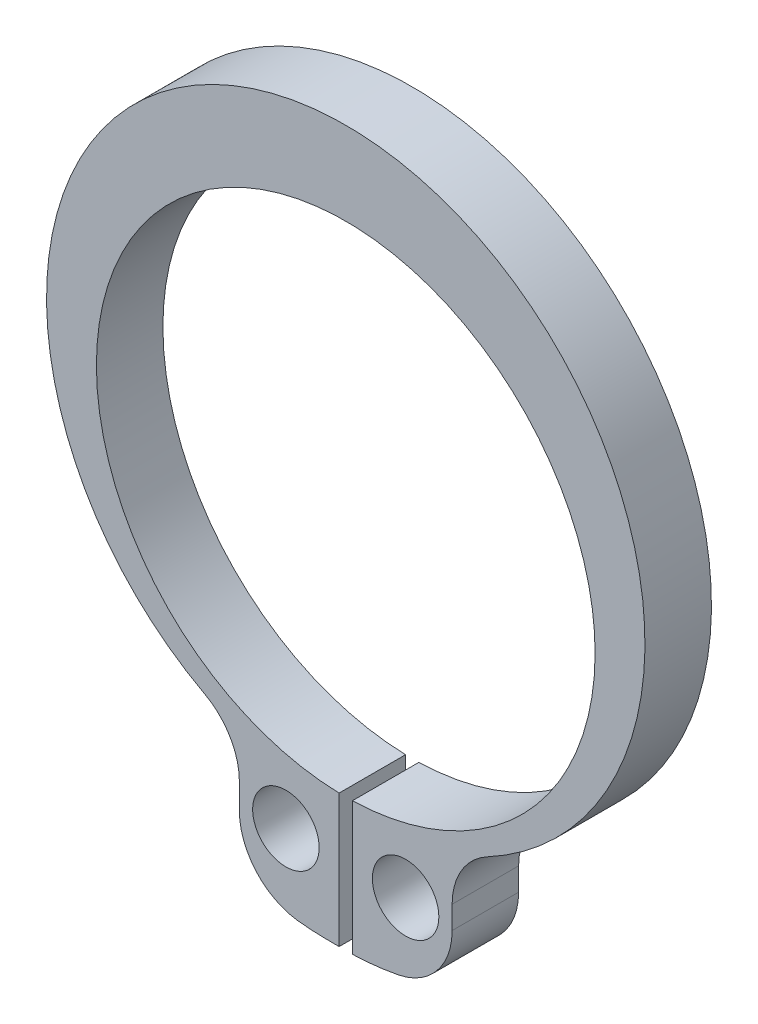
ISO-10303-21;
HEADER;
FILE_DESCRIPTION(('STEP AP214'),'2;1');
FILE_NAME('part.step','',(''),(''),'','','');
FILE_SCHEMA(('AUTOMOTIVE_DESIGN { 1 0 10303 214 1 1 1 1 }'));
ENDSEC;
DATA;
#1=APPLICATION_CONTEXT('core data for automotive mechanical design processes');
#2=APPLICATION_PROTOCOL_DEFINITION('international standard','automotive_design',2000,#1);
#3=PRODUCT_CONTEXT('',#1,'mechanical');
#4=PRODUCT('Part','Part','',(#3));
#5=PRODUCT_RELATED_PRODUCT_CATEGORY('part','',(#4));
#6=PRODUCT_DEFINITION_FORMATION('','',#4);
#7=PRODUCT_DEFINITION_CONTEXT('part definition',#1,'design');
#8=PRODUCT_DEFINITION('design','',#6,#7);
#9=PRODUCT_DEFINITION_SHAPE('','',#8);
#10=(LENGTH_UNIT() NAMED_UNIT(*) SI_UNIT(.MILLI.,.METRE.));
#11=(NAMED_UNIT(*) PLANE_ANGLE_UNIT() SI_UNIT($,.RADIAN.));
#12=(NAMED_UNIT(*) SI_UNIT($,.STERADIAN.) SOLID_ANGLE_UNIT());
#13=UNCERTAINTY_MEASURE_WITH_UNIT(LENGTH_MEASURE(1.E-05),#10,'distance_accuracy_value','');
#14=(GEOMETRIC_REPRESENTATION_CONTEXT(3) GLOBAL_UNCERTAINTY_ASSIGNED_CONTEXT((#13)) GLOBAL_UNIT_ASSIGNED_CONTEXT((#10,
#11,#12)) REPRESENTATION_CONTEXT('',''));
#15=CARTESIAN_POINT('',(0.,0.,0.));
#16=DIRECTION('',(0.,0.,1.));
#17=DIRECTION('',(1.,0.,0.));
#18=AXIS2_PLACEMENT_3D('',#15,#16,#17);
#19=CARTESIAN_POINT('',(0.,0.,1.));
#20=DIRECTION('',(0.,0.,-1.));
#21=DIRECTION('',(-1.,0.,0.));
#22=AXIS2_PLACEMENT_3D('',#19,#20,#21);
#23=CYLINDRICAL_SURFACE('',#22,3.75);
#24=CARTESIAN_POINT('',(0.,0.,0.));
#25=DIRECTION('',(0.,0.,-1.));
#26=DIRECTION('',(1.,0.,0.));
#27=AXIS2_PLACEMENT_3D('',#24,#25,#26);
#28=CIRCLE('',#27,3.75);
#29=CARTESIAN_POINT('',(-0.0999999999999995,-3.74866642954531,0.));
#30=VERTEX_POINT('',#29);
#31=CARTESIAN_POINT('',(0.1,-3.74866642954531,0.));
#32=VERTEX_POINT('',#31);
#33=EDGE_CURVE('E144',#30,#32,#28,.T.);
#34=ORIENTED_EDGE('',*,*,#33,.T.);
#35=DIRECTION('',(0.,0.,-1.));
#36=VECTOR('',#35,1.);
#37=CARTESIAN_POINT('',(0.1,-3.74866642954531,1.));
#38=LINE('',#37,#36);
#39=CARTESIAN_POINT('',(0.1,-3.74866642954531,1.));
#40=VERTEX_POINT('',#39);
#41=EDGE_CURVE('E125',#40,#32,#38,.T.);
#42=ORIENTED_EDGE('',*,*,#41,.F.);
#43=CARTESIAN_POINT('',(0.,0.,1.));
#44=DIRECTION('',(0.,0.,-1.));
#45=DIRECTION('',(1.,0.,0.));
#46=AXIS2_PLACEMENT_3D('',#43,#44,#45);
#47=CIRCLE('',#46,3.75);
#48=CARTESIAN_POINT('',(-0.0999999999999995,-3.74866642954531,1.));
#49=VERTEX_POINT('',#48);
#50=EDGE_CURVE('E132',#49,#40,#47,.T.);
#51=ORIENTED_EDGE('',*,*,#50,.F.);
#52=DIRECTION('',(0.,0.,-1.));
#53=VECTOR('',#52,1.);
#54=CARTESIAN_POINT('',(-0.0999999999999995,-3.74866642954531,1.));
#55=LINE('',#54,#53);
#56=EDGE_CURVE('E273',#49,#30,#55,.T.);
#57=ORIENTED_EDGE('',*,*,#56,.T.);
#58=EDGE_LOOP('',(#34,#42,#51,#57));
#59=FACE_BOUND('',#58,.T.);
#60=ADVANCED_FACE('F31',(#59),#23,.F.);
#61=CARTESIAN_POINT('',(0.1,-3.74866642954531,1.));
#62=DIRECTION('',(1.,0.,0.));
#63=DIRECTION('',(0.,1.,0.));
#64=AXIS2_PLACEMENT_3D('',#61,#62,#63);
#65=PLANE('',#64);
#66=DIRECTION('',(0.,-1.,0.));
#67=VECTOR('',#66,1.);
#68=CARTESIAN_POINT('',(0.1,-3.74866642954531,0.));
#69=LINE('',#68,#67);
#70=CARTESIAN_POINT('',(0.0999999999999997,-5.74866642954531,0.));
#71=VERTEX_POINT('',#70);
#72=EDGE_CURVE('E279',#32,#71,#69,.T.);
#73=ORIENTED_EDGE('',*,*,#72,.T.);
#74=DIRECTION('',(0.,0.,-1.));
#75=VECTOR('',#74,1.);
#76=CARTESIAN_POINT('',(0.0999999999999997,-5.74866642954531,1.));
#77=LINE('',#76,#75);
#78=CARTESIAN_POINT('',(0.0999999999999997,-5.74866642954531,1.));
#79=VERTEX_POINT('',#78);
#80=EDGE_CURVE('E128',#79,#71,#77,.T.);
#81=ORIENTED_EDGE('',*,*,#80,.F.);
#82=DIRECTION('',(0.,-1.,0.));
#83=VECTOR('',#82,1.);
#84=CARTESIAN_POINT('',(0.1,-3.74866642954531,1.));
#85=LINE('',#84,#83);
#86=EDGE_CURVE('E121',#40,#79,#85,.T.);
#87=ORIENTED_EDGE('',*,*,#86,.F.);
#88=ORIENTED_EDGE('',*,*,#41,.T.);
#89=EDGE_LOOP('',(#73,#81,#87,#88));
#90=FACE_BOUND('',#89,.T.);
#91=ADVANCED_FACE('F123',(#90),#65,.F.);
#92=CARTESIAN_POINT('',(-0.0174842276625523,-1.58267923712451,1.));
#93=DIRECTION('',(0.,0.,-1.));
#94=DIRECTION('',(-1.,0.,0.));
#95=AXIS2_PLACEMENT_3D('',#92,#93,#94);
#96=CYLINDRICAL_SURFACE('',#95,4.16764343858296);
#97=CARTESIAN_POINT('',(-0.0174842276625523,-1.58267923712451,0.));
#98=DIRECTION('',(0.,0.,1.));
#99=DIRECTION('',(1.,0.,0.));
#100=AXIS2_PLACEMENT_3D('',#97,#98,#99);
#101=CIRCLE('',#100,4.16764343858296);
#102=CARTESIAN_POINT('',(0.79493489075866,-5.67037137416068,0.));
#103=VERTEX_POINT('',#102);
#104=EDGE_CURVE('E195',#71,#103,#101,.T.);
#105=ORIENTED_EDGE('',*,*,#104,.T.);
#106=DIRECTION('',(0.,0.,-1.));
#107=VECTOR('',#106,1.);
#108=CARTESIAN_POINT('',(0.79493489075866,-5.67037137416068,1.));
#109=LINE('',#108,#107);
#110=CARTESIAN_POINT('',(0.79493489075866,-5.67037137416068,1.));
#111=VERTEX_POINT('',#110);
#112=EDGE_CURVE('E159',#103,#111,#109,.F.);
#113=ORIENTED_EDGE('',*,*,#112,.T.);
#114=CARTESIAN_POINT('',(-0.0174842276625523,-1.58267923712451,1.));
#115=DIRECTION('',(0.,0.,1.));
#116=DIRECTION('',(1.,0.,0.));
#117=AXIS2_PLACEMENT_3D('',#114,#115,#116);
#118=CIRCLE('',#117,4.16764343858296);
#119=EDGE_CURVE('E131',#79,#111,#118,.T.);
#120=ORIENTED_EDGE('',*,*,#119,.F.);
#121=ORIENTED_EDGE('',*,*,#80,.T.);
#122=EDGE_LOOP('',(#105,#113,#120,#121));
#123=FACE_BOUND('',#122,.T.);
#124=ADVANCED_FACE('F236',(#123),#96,.T.);
#125=CARTESIAN_POINT('',(1.6,-5.42364221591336,1.));
#126=DIRECTION('',(-1.,0.,0.));
#127=DIRECTION('',(0.,0.,1.));
#128=AXIS2_PLACEMENT_3D('',#125,#126,#127);
#129=PLANE('',#128);
#130=DIRECTION('',(0.,1.,0.));
#131=VECTOR('',#130,1.);
#132=CARTESIAN_POINT('',(1.6,-5.42364221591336,1.));
#133=LINE('',#132,#131);
#134=CARTESIAN_POINT('',(1.6,-4.68955518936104,1.));
#135=VERTEX_POINT('',#134);
#136=CARTESIAN_POINT('',(1.6,-4.34664832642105,1.));
#137=VERTEX_POINT('',#136);
#138=EDGE_CURVE('E202',#135,#137,#133,.T.);
#139=ORIENTED_EDGE('',*,*,#138,.F.);
#140=DIRECTION('',(0.,0.,-1.));
#141=VECTOR('',#140,1.);
#142=CARTESIAN_POINT('',(1.6,-4.68955518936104,1.));
#143=LINE('',#142,#141);
#144=CARTESIAN_POINT('',(1.6,-4.68955518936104,0.));
#145=VERTEX_POINT('',#144);
#146=EDGE_CURVE('E147',#135,#145,#143,.T.);
#147=ORIENTED_EDGE('',*,*,#146,.T.);
#148=DIRECTION('',(0.,1.,0.));
#149=VECTOR('',#148,1.);
#150=CARTESIAN_POINT('',(1.6,-5.42364221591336,0.));
#151=LINE('',#150,#149);
#152=CARTESIAN_POINT('',(1.6,-4.34664832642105,0.));
#153=VERTEX_POINT('',#152);
#154=EDGE_CURVE('E184',#145,#153,#151,.T.);
#155=ORIENTED_EDGE('',*,*,#154,.T.);
#156=DIRECTION('',(0.,0.,1.));
#157=VECTOR('',#156,1.);
#158=CARTESIAN_POINT('',(1.6,-4.34664832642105,1.));
#159=LINE('',#158,#157);
#160=EDGE_CURVE('E145',#153,#137,#159,.T.);
#161=ORIENTED_EDGE('',*,*,#160,.T.);
#162=EDGE_LOOP('',(#139,#147,#155,#161));
#163=FACE_BOUND('',#162,.T.);
#164=ADVANCED_FACE('F192',(#163),#129,.F.);
#165=CARTESIAN_POINT('',(0.,0.5,1.));
#166=DIRECTION('',(0.,0.,-1.));
#167=DIRECTION('',(-1.,0.,0.));
#168=AXIS2_PLACEMENT_3D('',#165,#166,#167);
#169=CYLINDRICAL_SURFACE('',#168,4.5);
#170=CARTESIAN_POINT('',(0.,0.5,0.));
#171=DIRECTION('',(0.,0.,1.));
#172=DIRECTION('',(1.,0.,0.));
#173=AXIS2_PLACEMENT_3D('',#170,#171,#172);
#174=CIRCLE('',#173,4.5);
#175=CARTESIAN_POINT('',(2.12727272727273,-3.46543953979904,0.));
#176=VERTEX_POINT('',#175);
#177=CARTESIAN_POINT('',(-2.12727272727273,-3.46543953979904,0.));
#178=VERTEX_POINT('',#177);
#179=EDGE_CURVE('E186',#176,#178,#174,.T.);
#180=ORIENTED_EDGE('',*,*,#179,.T.);
#181=DIRECTION('',(0.,0.,-1.));
#182=VECTOR('',#181,1.);
#183=CARTESIAN_POINT('',(-2.12727272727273,-3.46543953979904,1.));
#184=LINE('',#183,#182);
#185=CARTESIAN_POINT('',(-2.12727272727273,-3.46543953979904,1.));
#186=VERTEX_POINT('',#185);
#187=EDGE_CURVE('E174',#178,#186,#184,.F.);
#188=ORIENTED_EDGE('',*,*,#187,.T.);
#189=CARTESIAN_POINT('',(0.,0.5,1.));
#190=DIRECTION('',(0.,0.,1.));
#191=DIRECTION('',(1.,0.,0.));
#192=AXIS2_PLACEMENT_3D('',#189,#190,#191);
#193=CIRCLE('',#192,4.5);
#194=CARTESIAN_POINT('',(2.12727272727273,-3.46543953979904,1.));
#195=VERTEX_POINT('',#194);
#196=EDGE_CURVE('E200',#195,#186,#193,.T.);
#197=ORIENTED_EDGE('',*,*,#196,.F.);
#198=DIRECTION('',(0.,0.,-1.));
#199=VECTOR('',#198,1.);
#200=CARTESIAN_POINT('',(2.12727272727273,-3.46543953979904,1.));
#201=LINE('',#200,#199);
#202=EDGE_CURVE('E171',#195,#176,#201,.T.);
#203=ORIENTED_EDGE('',*,*,#202,.T.);
#204=EDGE_LOOP('',(#180,#188,#197,#203));
#205=FACE_BOUND('',#204,.T.);
#206=ADVANCED_FACE('F204',(#205),#169,.T.);
#207=CARTESIAN_POINT('',(-1.6,-5.438181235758,1.));
#208=DIRECTION('',(1.,0.,0.));
#209=DIRECTION('',(0.,1.,0.));
#210=AXIS2_PLACEMENT_3D('',#207,#208,#209);
#211=PLANE('',#210);
#212=DIRECTION('',(0.,-1.,0.));
#213=VECTOR('',#212,1.);
#214=CARTESIAN_POINT('',(-1.6,-5.438181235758,0.));
#215=LINE('',#214,#213);
#216=CARTESIAN_POINT('',(-1.6,-4.34664832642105,0.));
#217=VERTEX_POINT('',#216);
#218=CARTESIAN_POINT('',(-1.6,-4.72881648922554,0.));
#219=VERTEX_POINT('',#218);
#220=EDGE_CURVE('E260',#217,#219,#215,.T.);
#221=ORIENTED_EDGE('',*,*,#220,.T.);
#222=DIRECTION('',(0.,0.,-1.));
#223=VECTOR('',#222,1.);
#224=CARTESIAN_POINT('',(-1.6,-4.72881648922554,1.));
#225=LINE('',#224,#223);
#226=CARTESIAN_POINT('',(-1.6,-4.72881648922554,1.));
#227=VERTEX_POINT('',#226);
#228=EDGE_CURVE('E54',#219,#227,#225,.F.);
#229=ORIENTED_EDGE('',*,*,#228,.T.);
#230=DIRECTION('',(0.,-1.,0.));
#231=VECTOR('',#230,1.);
#232=CARTESIAN_POINT('',(-1.6,-5.438181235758,1.));
#233=LINE('',#232,#231);
#234=CARTESIAN_POINT('',(-1.6,-4.34664832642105,1.));
#235=VERTEX_POINT('',#234);
#236=EDGE_CURVE('E206',#235,#227,#233,.T.);
#237=ORIENTED_EDGE('',*,*,#236,.F.);
#238=DIRECTION('',(0.,0.,1.));
#239=VECTOR('',#238,1.);
#240=CARTESIAN_POINT('',(-1.6,-4.34664832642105,0.));
#241=LINE('',#240,#239);
#242=EDGE_CURVE('E167',#235,#217,#241,.F.);
#243=ORIENTED_EDGE('',*,*,#242,.T.);
#244=EDGE_LOOP('',(#221,#229,#237,#243));
#245=FACE_BOUND('',#244,.T.);
#246=ADVANCED_FACE('F227',(#245),#211,.F.);
#247=CARTESIAN_POINT('',(-1.6,-5.438181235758,1.));
#248=CARTESIAN_POINT('',(-1.37892950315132,-5.53557388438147,1.));
#249=CARTESIAN_POINT('',(-0.902113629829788,-5.74563520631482,1.));
#250=CARTESIAN_POINT('',(-0.380026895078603,-5.74760819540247,1.));
#251=CARTESIAN_POINT('',(-0.0999999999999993,-5.74866642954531,1.));
#252=B_SPLINE_CURVE_WITH_KNOTS('',3,(#247,#248,#249,#250,#251),.UNSPECIFIED.,.F.,.F.,(4,1,4),
(0.,0.463639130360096,1.),.UNSPECIFIED.);
#253=DIRECTION('',(0.,0.,-1.));
#254=VECTOR('',#253,1.);
#255=SURFACE_OF_LINEAR_EXTRUSION('',#252,#254);
#256=CARTESIAN_POINT('',(-0.727547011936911,-5.72064901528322,1.));
#257=VERTEX_POINT('',#256);
#258=CARTESIAN_POINT('',(-0.0999999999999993,-5.74866642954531,1.));
#259=VERTEX_POINT('',#258);
#260=EDGE_CURVE('E208',#257,#259,#252,.T.);
#261=ORIENTED_EDGE('',*,*,#260,.F.);
#262=DIRECTION('',(0.,0.,-1.));
#263=VECTOR('',#262,1.);
#264=CARTESIAN_POINT('',(-0.727547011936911,-5.72064901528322,1.));
#265=LINE('',#264,#263);
#266=CARTESIAN_POINT('',(-0.727547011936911,-5.72064901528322,0.));
#267=VERTEX_POINT('',#266);
#268=EDGE_CURVE('E164',#257,#267,#265,.T.);
#269=ORIENTED_EDGE('',*,*,#268,.T.);
#270=CARTESIAN_POINT('',(-1.6,-5.438181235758,0.));
#271=CARTESIAN_POINT('',(-1.37892950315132,-5.53557388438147,0.));
#272=CARTESIAN_POINT('',(-0.902113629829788,-5.74563520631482,0.));
#273=CARTESIAN_POINT('',(-0.380026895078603,-5.74760819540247,0.));
#274=CARTESIAN_POINT('',(-0.0999999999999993,-5.74866642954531,0.));
#275=B_SPLINE_CURVE_WITH_KNOTS('',3,(#270,#271,#272,#273,#274),.UNSPECIFIED.,.F.,.F.,(4,1,4),
(0.,0.463639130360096,1.),.UNSPECIFIED.);
#276=CARTESIAN_POINT('',(-0.0999999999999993,-5.74866642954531,0.));
#277=VERTEX_POINT('',#276);
#278=EDGE_CURVE('E262',#267,#277,#275,.T.);
#279=ORIENTED_EDGE('',*,*,#278,.T.);
#280=DIRECTION('',(0.,0.,-1.));
#281=VECTOR('',#280,1.);
#282=CARTESIAN_POINT('',(-0.0999999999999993,-5.74866642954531,1.));
#283=LINE('',#282,#281);
#284=EDGE_CURVE('E149',#259,#277,#283,.T.);
#285=ORIENTED_EDGE('',*,*,#284,.F.);
#286=EDGE_LOOP('',(#261,#269,#279,#285));
#287=FACE_BOUND('',#286,.T.);
#288=ADVANCED_FACE('F222',(#287),#255,.F.);
#289=CARTESIAN_POINT('',(-0.0999999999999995,-3.74866642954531,1.));
#290=DIRECTION('',(-1.,0.,0.));
#291=DIRECTION('',(0.,-1.,0.));
#292=AXIS2_PLACEMENT_3D('',#289,#290,#291);
#293=PLANE('',#292);
#294=DIRECTION('',(0.,1.,0.));
#295=VECTOR('',#294,1.);
#296=CARTESIAN_POINT('',(-0.0999999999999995,-3.74866642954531,0.));
#297=LINE('',#296,#295);
#298=EDGE_CURVE('E141',#277,#30,#297,.T.);
#299=ORIENTED_EDGE('',*,*,#298,.T.);
#300=ORIENTED_EDGE('',*,*,#56,.F.);
#301=DIRECTION('',(0.,1.,0.));
#302=VECTOR('',#301,1.);
#303=CARTESIAN_POINT('',(-0.0999999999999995,-3.74866642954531,1.));
#304=LINE('',#303,#302);
#305=EDGE_CURVE('E137',#259,#49,#304,.T.);
#306=ORIENTED_EDGE('',*,*,#305,.F.);
#307=ORIENTED_EDGE('',*,*,#284,.T.);
#308=EDGE_LOOP('',(#299,#300,#306,#307));
#309=FACE_BOUND('',#308,.T.);
#310=ADVANCED_FACE('F226',(#309),#293,.F.);
#311=CARTESIAN_POINT('',(0.,0.,1.));
#312=DIRECTION('',(0.,0.,1.));
#313=DIRECTION('',(1.,0.,0.));
#314=AXIS2_PLACEMENT_3D('',#311,#312,#313);
#315=PLANE('',#314);
#316=CARTESIAN_POINT('',(0.900000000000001,-4.61082767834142,1.));
#317=DIRECTION('',(0.,0.,1.));
#318=DIRECTION('',(1.,0.,0.));
#319=AXIS2_PLACEMENT_3D('',#316,#317,#318);
#320=CIRCLE('',#319,0.5);
#321=CARTESIAN_POINT('',(1.4,-4.61082767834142,1.));
#322=VERTEX_POINT('',#321);
#323=EDGE_CURVE('E293',#322,#322,#320,.T.);
#324=ORIENTED_EDGE('',*,*,#323,.F.);
#325=EDGE_LOOP('',(#324));
#326=FACE_BOUND('',#325,.T.);
#327=CARTESIAN_POINT('',(-0.9,-4.61082767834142,1.));
#328=DIRECTION('',(0.,0.,1.));
#329=DIRECTION('',(1.,0.,0.));
#330=AXIS2_PLACEMENT_3D('',#327,#328,#329);
#331=CIRCLE('',#330,0.5);
#332=CARTESIAN_POINT('',(-0.4,-4.61082767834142,1.));
#333=VERTEX_POINT('',#332);
#334=EDGE_CURVE('E283',#333,#333,#331,.T.);
#335=ORIENTED_EDGE('',*,*,#334,.F.);
#336=EDGE_LOOP('',(#335));
#337=FACE_BOUND('',#336,.T.);
#338=ORIENTED_EDGE('',*,*,#119,.T.);
#339=CARTESIAN_POINT('',(0.600000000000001,-4.68955518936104,1.));
#340=DIRECTION('',(0.,0.,1.));
#341=DIRECTION('',(1.,0.,0.));
#342=AXIS2_PLACEMENT_3D('',#339,#340,#341);
#343=CIRCLE('',#342,1.);
#344=EDGE_CURVE('E162',#111,#135,#343,.T.);
#345=ORIENTED_EDGE('',*,*,#344,.T.);
#346=ORIENTED_EDGE('',*,*,#138,.T.);
#347=CARTESIAN_POINT('',(2.6,-4.34664832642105,1.));
#348=DIRECTION('',(0.,0.,1.));
#349=DIRECTION('',(1.,0.,0.));
#350=AXIS2_PLACEMENT_3D('',#347,#348,#349);
#351=CIRCLE('',#350,1.);
#352=EDGE_CURVE('E11',#137,#195,#351,.F.);
#353=ORIENTED_EDGE('',*,*,#352,.T.);
#354=ORIENTED_EDGE('',*,*,#196,.T.);
#355=CARTESIAN_POINT('',(-2.6,-4.34664832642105,1.));
#356=DIRECTION('',(0.,0.,1.));
#357=DIRECTION('',(1.,0.,0.));
#358=AXIS2_PLACEMENT_3D('',#355,#356,#357);
#359=CIRCLE('',#358,1.);
#360=EDGE_CURVE('E178',#186,#235,#359,.F.);
#361=ORIENTED_EDGE('',*,*,#360,.T.);
#362=ORIENTED_EDGE('',*,*,#236,.T.);
#363=CARTESIAN_POINT('',(-0.600000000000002,-4.72881648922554,1.));
#364=DIRECTION('',(0.,0.,1.));
#365=DIRECTION('',(1.,0.,0.));
#366=AXIS2_PLACEMENT_3D('',#363,#364,#365);
#367=CIRCLE('',#366,1.);
#368=EDGE_CURVE('E46',#227,#257,#367,.T.);
#369=ORIENTED_EDGE('',*,*,#368,.T.);
#370=ORIENTED_EDGE('',*,*,#260,.T.);
#371=ORIENTED_EDGE('',*,*,#305,.T.);
#372=ORIENTED_EDGE('',*,*,#50,.T.);
#373=ORIENTED_EDGE('',*,*,#86,.T.);
#374=EDGE_LOOP('',(#338,#345,#346,#353,#354,#361,#362,#369,#370,#371,#372,#373));
#375=FACE_BOUND('',#374,.T.);
#376=ADVANCED_FACE('F135',(#326,#337,#375),#315,.T.);
#377=CARTESIAN_POINT('',(0.,0.,0.));
#378=DIRECTION('',(0.,0.,1.));
#379=DIRECTION('',(1.,0.,0.));
#380=AXIS2_PLACEMENT_3D('',#377,#378,#379);
#381=PLANE('',#380);
#382=CARTESIAN_POINT('',(0.900000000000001,-4.61082767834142,0.));
#383=DIRECTION('',(0.,0.,1.));
#384=DIRECTION('',(1.,0.,0.));
#385=AXIS2_PLACEMENT_3D('',#382,#383,#384);
#386=CIRCLE('',#385,0.5);
#387=CARTESIAN_POINT('',(1.4,-4.61082767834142,0.));
#388=VERTEX_POINT('',#387);
#389=EDGE_CURVE('E291',#388,#388,#386,.T.);
#390=ORIENTED_EDGE('',*,*,#389,.T.);
#391=EDGE_LOOP('',(#390));
#392=FACE_BOUND('',#391,.T.);
#393=CARTESIAN_POINT('',(-0.9,-4.61082767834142,0.));
#394=DIRECTION('',(0.,0.,1.));
#395=DIRECTION('',(1.,0.,0.));
#396=AXIS2_PLACEMENT_3D('',#393,#394,#395);
#397=CIRCLE('',#396,0.5);
#398=CARTESIAN_POINT('',(-0.4,-4.61082767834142,0.));
#399=VERTEX_POINT('',#398);
#400=EDGE_CURVE('E280',#399,#399,#397,.T.);
#401=ORIENTED_EDGE('',*,*,#400,.T.);
#402=EDGE_LOOP('',(#401));
#403=FACE_BOUND('',#402,.T.);
#404=ORIENTED_EDGE('',*,*,#154,.F.);
#405=CARTESIAN_POINT('',(0.600000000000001,-4.68955518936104,0.));
#406=DIRECTION('',(0.,0.,1.));
#407=DIRECTION('',(1.,0.,0.));
#408=AXIS2_PLACEMENT_3D('',#405,#406,#407);
#409=CIRCLE('',#408,1.);
#410=EDGE_CURVE('E157',#145,#103,#409,.F.);
#411=ORIENTED_EDGE('',*,*,#410,.T.);
#412=ORIENTED_EDGE('',*,*,#104,.F.);
#413=ORIENTED_EDGE('',*,*,#72,.F.);
#414=ORIENTED_EDGE('',*,*,#33,.F.);
#415=ORIENTED_EDGE('',*,*,#298,.F.);
#416=ORIENTED_EDGE('',*,*,#278,.F.);
#417=CARTESIAN_POINT('',(-0.600000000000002,-4.72881648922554,0.));
#418=DIRECTION('',(0.,0.,1.));
#419=DIRECTION('',(1.,0.,0.));
#420=AXIS2_PLACEMENT_3D('',#417,#418,#419);
#421=CIRCLE('',#420,1.);
#422=EDGE_CURVE('E155',#267,#219,#421,.F.);
#423=ORIENTED_EDGE('',*,*,#422,.T.);
#424=ORIENTED_EDGE('',*,*,#220,.F.);
#425=CARTESIAN_POINT('',(-2.6,-4.34664832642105,0.));
#426=DIRECTION('',(0.,0.,1.));
#427=DIRECTION('',(1.,0.,0.));
#428=AXIS2_PLACEMENT_3D('',#425,#426,#427);
#429=CIRCLE('',#428,1.);
#430=EDGE_CURVE('E176',#217,#178,#429,.T.);
#431=ORIENTED_EDGE('',*,*,#430,.T.);
#432=ORIENTED_EDGE('',*,*,#179,.F.);
#433=CARTESIAN_POINT('',(2.6,-4.34664832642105,0.));
#434=DIRECTION('',(0.,0.,1.));
#435=DIRECTION('',(1.,0.,0.));
#436=AXIS2_PLACEMENT_3D('',#433,#434,#435);
#437=CIRCLE('',#436,1.);
#438=EDGE_CURVE('E39',#176,#153,#437,.T.);
#439=ORIENTED_EDGE('',*,*,#438,.T.);
#440=EDGE_LOOP('',(#404,#411,#412,#413,#414,#415,#416,#423,#424,#431,#432,#439));
#441=FACE_BOUND('',#440,.T.);
#442=ADVANCED_FACE('F183',(#392,#403,#441),#381,.F.);
#443=CARTESIAN_POINT('',(-0.9,-4.61082767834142,0.));
#444=DIRECTION('',(0.,0.,1.));
#445=DIRECTION('',(1.,0.,0.));
#446=AXIS2_PLACEMENT_3D('',#443,#444,#445);
#447=CYLINDRICAL_SURFACE('',#446,0.5);
#448=ORIENTED_EDGE('',*,*,#400,.F.);
#449=EDGE_LOOP('',(#448));
#450=FACE_BOUND('',#449,.T.);
#451=ORIENTED_EDGE('',*,*,#334,.T.);
#452=EDGE_LOOP('',(#451));
#453=FACE_BOUND('',#452,.T.);
#454=ADVANCED_FACE('F303',(#450,#453),#447,.F.);
#455=CARTESIAN_POINT('',(0.900000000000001,-4.61082767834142,0.));
#456=DIRECTION('',(0.,0.,1.));
#457=DIRECTION('',(1.,0.,0.));
#458=AXIS2_PLACEMENT_3D('',#455,#456,#457);
#459=CYLINDRICAL_SURFACE('',#458,0.5);
#460=ORIENTED_EDGE('',*,*,#389,.F.);
#461=EDGE_LOOP('',(#460));
#462=FACE_BOUND('',#461,.T.);
#463=ORIENTED_EDGE('',*,*,#323,.T.);
#464=EDGE_LOOP('',(#463));
#465=FACE_BOUND('',#464,.T.);
#466=ADVANCED_FACE('F248',(#462,#465),#459,.F.);
#467=CARTESIAN_POINT('',(0.600000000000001,-4.68955518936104,1.));
#468=DIRECTION('',(0.,0.,-1.));
#469=DIRECTION('',(-1.,0.,0.));
#470=AXIS2_PLACEMENT_3D('',#467,#468,#469);
#471=CYLINDRICAL_SURFACE('',#470,1.);
#472=ORIENTED_EDGE('',*,*,#344,.F.);
#473=ORIENTED_EDGE('',*,*,#112,.F.);
#474=ORIENTED_EDGE('',*,*,#410,.F.);
#475=ORIENTED_EDGE('',*,*,#146,.F.);
#476=EDGE_LOOP('',(#472,#473,#474,#475));
#477=FACE_BOUND('',#476,.T.);
#478=ADVANCED_FACE('F244',(#477),#471,.T.);
#479=CARTESIAN_POINT('',(-0.600000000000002,-4.72881648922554,0.5));
#480=DIRECTION('',(0.,0.,-1.));
#481=DIRECTION('',(-1.,0.,0.));
#482=AXIS2_PLACEMENT_3D('',#479,#480,#481);
#483=CYLINDRICAL_SURFACE('',#482,1.);
#484=ORIENTED_EDGE('',*,*,#368,.F.);
#485=ORIENTED_EDGE('',*,*,#228,.F.);
#486=ORIENTED_EDGE('',*,*,#422,.F.);
#487=ORIENTED_EDGE('',*,*,#268,.F.);
#488=EDGE_LOOP('',(#484,#485,#486,#487));
#489=FACE_BOUND('',#488,.T.);
#490=ADVANCED_FACE('F247',(#489),#483,.T.);
#491=CARTESIAN_POINT('',(-2.6,-4.34664832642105,1.));
#492=DIRECTION('',(0.,0.,-1.));
#493=DIRECTION('',(-1.,0.,0.));
#494=AXIS2_PLACEMENT_3D('',#491,#492,#493);
#495=CYLINDRICAL_SURFACE('',#494,1.);
#496=ORIENTED_EDGE('',*,*,#360,.F.);
#497=ORIENTED_EDGE('',*,*,#187,.F.);
#498=ORIENTED_EDGE('',*,*,#430,.F.);
#499=ORIENTED_EDGE('',*,*,#242,.F.);
#500=EDGE_LOOP('',(#496,#497,#498,#499));
#501=FACE_BOUND('',#500,.T.);
#502=ADVANCED_FACE('F251',(#501),#495,.F.);
#503=CARTESIAN_POINT('',(2.6,-4.34664832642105,1.));
#504=DIRECTION('',(0.,0.,-1.));
#505=DIRECTION('',(-1.,0.,0.));
#506=AXIS2_PLACEMENT_3D('',#503,#504,#505);
#507=CYLINDRICAL_SURFACE('',#506,1.);
#508=ORIENTED_EDGE('',*,*,#352,.F.);
#509=ORIENTED_EDGE('',*,*,#160,.F.);
#510=ORIENTED_EDGE('',*,*,#438,.F.);
#511=ORIENTED_EDGE('',*,*,#202,.F.);
#512=EDGE_LOOP('',(#508,#509,#510,#511));
#513=FACE_BOUND('',#512,.T.);
#514=ADVANCED_FACE('F33',(#513),#507,.F.);
#515=CLOSED_SHELL('',(#60,#91,#124,#164,#206,#246,#288,#310,#376,#442,#454,#466,#478,#490,#502,#514));
#516=MANIFOLD_SOLID_BREP('B2',#515);
#517=ADVANCED_BREP_SHAPE_REPRESENTATION('',(#18,#516),#14);
#518=SHAPE_DEFINITION_REPRESENTATION(#9,#517);
ENDSEC;
END-ISO-10303-21;
